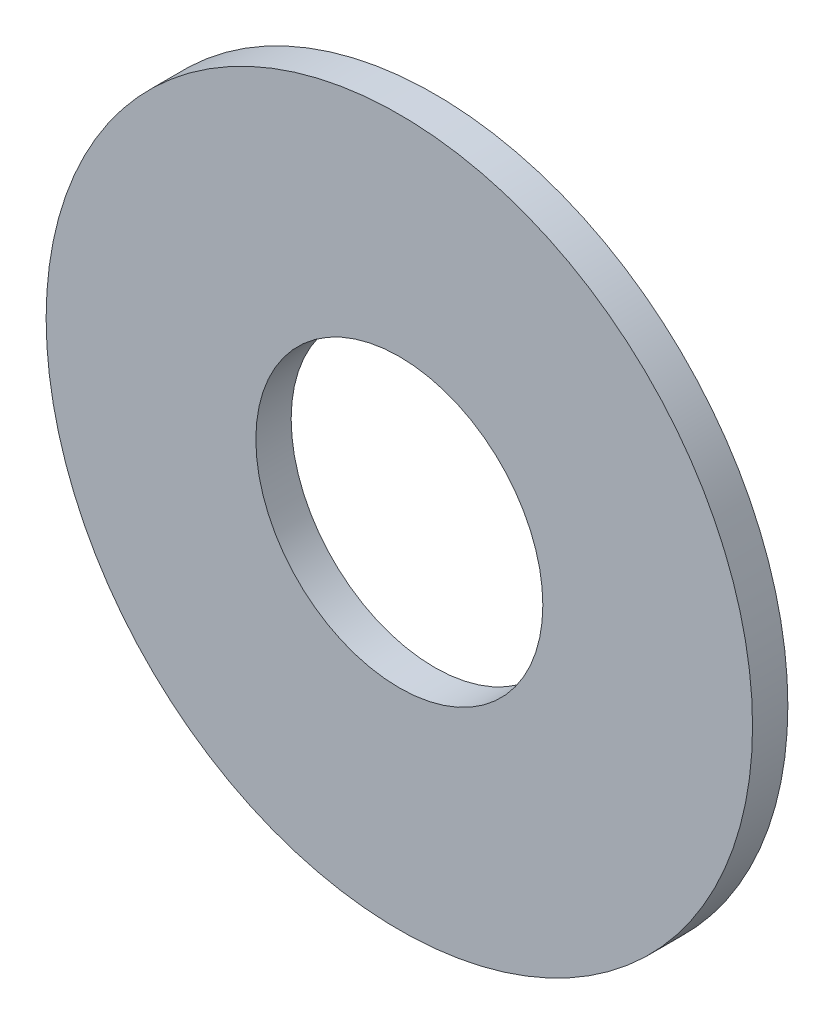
ISO-10303-21;
HEADER;
FILE_DESCRIPTION(('STEP AP214'),'2;1');
FILE_NAME('part.step','',(''),(''),'','','');
FILE_SCHEMA(('AUTOMOTIVE_DESIGN { 1 0 10303 214 1 1 1 1 }'));
ENDSEC;
DATA;
#1=APPLICATION_CONTEXT('core data for automotive mechanical design processes');
#2=APPLICATION_PROTOCOL_DEFINITION('international standard','automotive_design',2000,#1);
#3=PRODUCT_CONTEXT('',#1,'mechanical');
#4=PRODUCT('Part','Part','',(#3));
#5=PRODUCT_RELATED_PRODUCT_CATEGORY('part','',(#4));
#6=PRODUCT_DEFINITION_FORMATION('','',#4);
#7=PRODUCT_DEFINITION_CONTEXT('part definition',#1,'design');
#8=PRODUCT_DEFINITION('design','',#6,#7);
#9=PRODUCT_DEFINITION_SHAPE('','',#8);
#10=(LENGTH_UNIT() NAMED_UNIT(*) SI_UNIT(.MILLI.,.METRE.));
#11=(NAMED_UNIT(*) PLANE_ANGLE_UNIT() SI_UNIT($,.RADIAN.));
#12=(NAMED_UNIT(*) SI_UNIT($,.STERADIAN.) SOLID_ANGLE_UNIT());
#13=UNCERTAINTY_MEASURE_WITH_UNIT(LENGTH_MEASURE(1.E-05),#10,'distance_accuracy_value','');
#14=(GEOMETRIC_REPRESENTATION_CONTEXT(3) GLOBAL_UNCERTAINTY_ASSIGNED_CONTEXT((#13)) GLOBAL_UNIT_ASSIGNED_CONTEXT((#10,
#11,#12)) REPRESENTATION_CONTEXT('',''));
#15=CARTESIAN_POINT('',(0.,0.,0.));
#16=DIRECTION('',(0.,0.,1.));
#17=DIRECTION('',(1.,0.,0.));
#18=AXIS2_PLACEMENT_3D('',#15,#16,#17);
#19=CARTESIAN_POINT('',(0.,0.,2.54));
#20=DIRECTION('',(0.,0.,-1.));
#21=DIRECTION('',(-1.,0.,0.));
#22=AXIS2_PLACEMENT_3D('',#19,#20,#21);
#23=CYLINDRICAL_SURFACE('',#22,25.4);
#24=CARTESIAN_POINT('',(0.,0.,2.54));
#25=DIRECTION('',(0.,0.,1.));
#26=DIRECTION('',(1.,0.,0.));
#27=AXIS2_PLACEMENT_3D('',#24,#25,#26);
#28=CIRCLE('',#27,25.4);
#29=CARTESIAN_POINT('',(25.4,0.,2.54));
#30=VERTEX_POINT('',#29);
#31=EDGE_CURVE('E10',#30,#30,#28,.T.);
#32=ORIENTED_EDGE('',*,*,#31,.F.);
#33=EDGE_LOOP('',(#32));
#34=FACE_BOUND('',#33,.T.);
#35=CARTESIAN_POINT('',(0.,0.,0.));
#36=DIRECTION('',(0.,0.,1.));
#37=DIRECTION('',(1.,0.,0.));
#38=AXIS2_PLACEMENT_3D('',#35,#36,#37);
#39=CIRCLE('',#38,25.4);
#40=CARTESIAN_POINT('',(25.4,0.,0.));
#41=VERTEX_POINT('',#40);
#42=EDGE_CURVE('E32',#41,#41,#39,.T.);
#43=ORIENTED_EDGE('',*,*,#42,.T.);
#44=EDGE_LOOP('',(#43));
#45=FACE_BOUND('',#44,.T.);
#46=ADVANCED_FACE('F29',(#34,#45),#23,.T.);
#47=CARTESIAN_POINT('',(0.,0.,2.54));
#48=DIRECTION('',(0.,0.,1.));
#49=DIRECTION('',(1.,0.,0.));
#50=AXIS2_PLACEMENT_3D('',#47,#48,#49);
#51=PLANE('',#50);
#52=CARTESIAN_POINT('',(0.,0.,2.54));
#53=DIRECTION('',(0.,0.,1.));
#54=DIRECTION('',(1.,0.,0.));
#55=AXIS2_PLACEMENT_3D('',#52,#53,#54);
#56=CIRCLE('',#55,10.31875);
#57=CARTESIAN_POINT('',(10.31875,0.,2.54));
#58=VERTEX_POINT('',#57);
#59=EDGE_CURVE('E41',#58,#58,#56,.T.);
#60=ORIENTED_EDGE('',*,*,#59,.F.);
#61=EDGE_LOOP('',(#60));
#62=FACE_BOUND('',#61,.T.);
#63=ORIENTED_EDGE('',*,*,#31,.T.);
#64=EDGE_LOOP('',(#63));
#65=FACE_BOUND('',#64,.T.);
#66=ADVANCED_FACE('F56',(#62,#65),#51,.T.);
#67=CARTESIAN_POINT('',(0.,0.,0.));
#68=DIRECTION('',(0.,0.,1.));
#69=DIRECTION('',(1.,0.,0.));
#70=AXIS2_PLACEMENT_3D('',#67,#68,#69);
#71=PLANE('',#70);
#72=CARTESIAN_POINT('',(0.,0.,0.));
#73=DIRECTION('',(0.,0.,1.));
#74=DIRECTION('',(1.,0.,0.));
#75=AXIS2_PLACEMENT_3D('',#72,#73,#74);
#76=CIRCLE('',#75,10.31875);
#77=CARTESIAN_POINT('',(10.31875,0.,0.));
#78=VERTEX_POINT('',#77);
#79=EDGE_CURVE('E39',#78,#78,#76,.T.);
#80=ORIENTED_EDGE('',*,*,#79,.T.);
#81=EDGE_LOOP('',(#80));
#82=FACE_BOUND('',#81,.T.);
#83=ORIENTED_EDGE('',*,*,#42,.F.);
#84=EDGE_LOOP('',(#83));
#85=FACE_BOUND('',#84,.T.);
#86=ADVANCED_FACE('F47',(#82,#85),#71,.F.);
#87=CARTESIAN_POINT('',(0.,0.,0.));
#88=DIRECTION('',(0.,0.,1.));
#89=DIRECTION('',(1.,0.,0.));
#90=AXIS2_PLACEMENT_3D('',#87,#88,#89);
#91=CYLINDRICAL_SURFACE('',#90,10.31875);
#92=ORIENTED_EDGE('',*,*,#79,.F.);
#93=EDGE_LOOP('',(#92));
#94=FACE_BOUND('',#93,.T.);
#95=ORIENTED_EDGE('',*,*,#59,.T.);
#96=EDGE_LOOP('',(#95));
#97=FACE_BOUND('',#96,.T.);
#98=ADVANCED_FACE('F50',(#94,#97),#91,.F.);
#99=CLOSED_SHELL('',(#46,#66,#86,#98));
#100=MANIFOLD_SOLID_BREP('B2',#99);
#101=ADVANCED_BREP_SHAPE_REPRESENTATION('',(#18,#100),#14);
#102=SHAPE_DEFINITION_REPRESENTATION(#9,#101);
ENDSEC;
END-ISO-10303-21;
